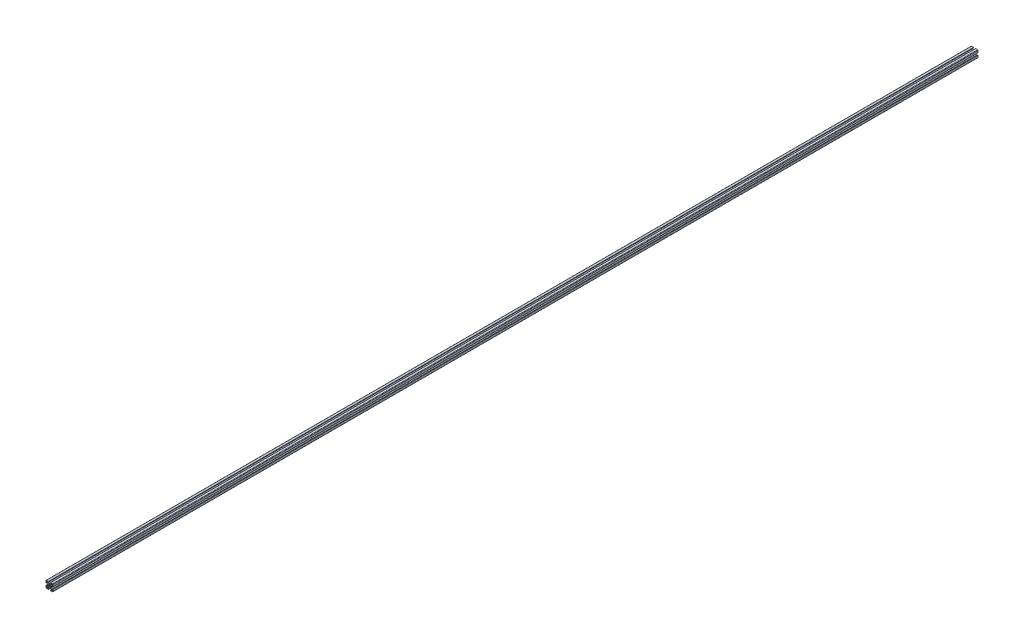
from build123d import *

# Parameters (mm, degrees)
EXTRUDE1_DEPTH = 4000


with BuildPart() as part:
    # Sketch1 → Extrude1 (new body)
    with BuildSketch(Plane.XY):
        with BuildLine():
            Line((12.74247465, -4.5), (12.74247465, -7.732519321))
            ThreePointArc((12.74247465, -7.732519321), (12.602449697, -8.097296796), (12.242781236, -8.249967))
            Line((12.242781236, -8.249967), (10.260188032, -8.249967))
            ThreePointArc((10.260188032, -8.249967), (10.068847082, -8.211906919), (9.906636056, -8.103520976))
            Line((9.906636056, -8.103520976), (5.981117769, -4.178002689))
            ThreePointArc((5.981117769, -4.178002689), (5.872731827, -4.015791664), (5.834671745, -3.824450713))
            Line((5.834671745, -3.824450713), (5.834671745, -1.01249595))
            Line((5.834671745, -1.01249595), (5.324673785, -0.06249975))
            Line((5.324673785, -0.06249975), (5.834671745, 0.88749645))
            Line((5.834671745, 0.88749645), (5.834671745, 3.824450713))
            ThreePointArc((5.834671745, 3.824450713), (5.872731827, 4.015791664), (5.981117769, 4.178002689))
            Line((5.981117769, 4.178002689), (9.906636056, 8.103520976))
            ThreePointArc((9.906636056, 8.103520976), (10.068847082, 8.211906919), (10.260188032, 8.249967))
            Line((10.260188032, 8.249967), (12.242781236, 8.249967))
            ThreePointArc((12.242781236, 8.249967), (12.602449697, 8.097296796), (12.74247465, 7.732519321))
            Line((12.74247465, 7.732519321), (12.74247465, 4.5))
            ThreePointArc((12.74247465, 4.5), (12.88892126, 4.146446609), (13.24247465, 4))
            Line((13.24247465, 4), (14.49994, 4))
            ThreePointArc((14.49994, 4), (14.853493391, 4.146446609), (14.99994, 4.5))
            Line((14.99994, 4.5), (14.99994, 12.999948))
            ThreePointArc((14.99994, 12.999948), (14.414155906, 14.414155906), (12.999948, 14.99994))
            Line((12.999948, 14.99994), (4.5, 14.99994))
            ThreePointArc((4.5, 14.99994), (4.146446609, 14.853493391), (4, 14.49994))
            Line((4, 14.49994), (4, 13.24247465))
            ThreePointArc((4, 13.24247465), (4.146446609, 12.88892126), (4.5, 12.74247465))
            Line((4.5, 12.74247465), (7.732519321, 12.74247465))
            ThreePointArc((7.732519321, 12.74247465), (8.097296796, 12.602449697), (8.249967, 12.242781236))
            Line((8.249967, 12.242781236), (8.249967, 10.260188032))
            ThreePointArc((8.249967, 10.260188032), (8.211906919, 10.068847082), (8.103520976, 9.906636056))
            Line((8.103520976, 9.906636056), (4.178002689, 5.981117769))
            ThreePointArc((4.178002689, 5.981117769), (4.015791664, 5.872731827), (3.824450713, 5.834671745))
            Line((3.824450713, 5.834671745), (0.9499962, 5.834671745))
            Line((0.9499962, 5.834671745), (0, 5.324673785))
            Line((0, 5.324673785), (-0.9499962, 5.834671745))
            Line((-0.9499962, 5.834671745), (-3.824450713, 5.834671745))
            ThreePointArc((-3.824450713, 5.834671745), (-4.015791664, 5.872731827), (-4.178002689, 5.981117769))
            Line((-4.178002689, 5.981117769), (-8.103520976, 9.906636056))
            ThreePointArc((-8.103520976, 9.906636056), (-8.211906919, 10.068847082), (-8.249967, 10.260188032))
            Line((-8.249967, 10.260188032), (-8.249967, 12.242781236))
            ThreePointArc((-8.249967, 12.242781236), (-8.097296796, 12.602449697), (-7.732519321, 12.74247465))
            Line((-7.732519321, 12.74247465), (-4.5, 12.74247465))
            ThreePointArc((-4.5, 12.74247465), (-4.146446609, 12.88892126), (-4, 13.24247465))
            Line((-4, 13.24247465), (-4, 14.49994))
            ThreePointArc((-4, 14.49994), (-4.146446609, 14.853493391), (-4.5, 14.99994))
            Line((-4.5, 14.99994), (-12.999948, 14.99994))
            ThreePointArc((-12.999948, 14.99994), (-14.414155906, 14.414155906), (-14.99994, 12.999948))
            Line((-14.99994, 12.999948), (-14.99994, 4.5))
            ThreePointArc((-14.99994, 4.5), (-14.853493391, 4.146446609), (-14.49994, 4))
            Line((-14.49994, 4), (-13.24247465, 4))
            ThreePointArc((-13.24247465, 4), (-12.88892126, 4.146446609), (-12.74247465, 4.5))
            Line((-12.74247465, 4.5), (-12.74247465, 7.732519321))
            ThreePointArc((-12.74247465, 7.732519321), (-12.602449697, 8.097296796), (-12.242781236, 8.249967))
            Line((-12.242781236, 8.249967), (-10.260188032, 8.249967))
            ThreePointArc((-10.260188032, 8.249967), (-10.068847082, 8.211906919), (-9.906636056, 8.103520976))
            Line((-9.906636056, 8.103520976), (-5.981117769, 4.178002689))
            ThreePointArc((-5.981117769, 4.178002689), (-5.872731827, 4.015791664), (-5.834671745, 3.824450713))
            Line((-5.834671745, 3.824450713), (-5.834671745, 0.88749645))
            Line((-5.834671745, 0.88749645), (-5.324673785, -0.06249975))
            Line((-5.324673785, -0.06249975), (-5.834671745, -1.01249595))
            Line((-5.834671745, -1.01249595), (-5.834671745, -3.824450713))
            ThreePointArc((-5.834671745, -3.824450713), (-5.872731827, -4.015791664), (-5.981117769, -4.178002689))
            Line((-5.981117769, -4.178002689), (-9.906636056, -8.103520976))
            ThreePointArc((-9.906636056, -8.103520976), (-10.068847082, -8.211906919), (-10.260188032, -8.249967))
            Line((-10.260188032, -8.249967), (-12.242781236, -8.249967))
            ThreePointArc((-12.242781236, -8.249967), (-12.602449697, -8.097296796), (-12.74247465, -7.732519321))
            Line((-12.74247465, -7.732519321), (-12.74247465, -4.5))
            ThreePointArc((-12.74247465, -4.5), (-12.88892126, -4.146446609), (-13.24247465, -4))
            Line((-13.24247465, -4), (-14.49994, -4))
            ThreePointArc((-14.49994, -4), (-14.853493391, -4.146446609), (-14.99994, -4.5))
            Line((-14.99994, -4.5), (-14.99994, -12.999948))
            ThreePointArc((-14.99994, -12.999948), (-14.414155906, -14.414155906), (-12.999948, -14.99994))
            Line((-12.999948, -14.99994), (-4.5, -14.99994))
            ThreePointArc((-4.5, -14.99994), (-4.146446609, -14.853493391), (-4, -14.49994))
            Line((-4, -14.49994), (-4, -13.24247465))
            ThreePointArc((-4, -13.24247465), (-4.146446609, -12.88892126), (-4.5, -12.74247465))
            Line((-4.5, -12.74247465), (-7.732519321, -12.74247465))
            ThreePointArc((-7.732519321, -12.74247465), (-8.097296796, -12.602449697), (-8.249967, -12.242781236))
            Line((-8.249967, -12.242781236), (-8.249967, -10.260188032))
            ThreePointArc((-8.249967, -10.260188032), (-8.211906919, -10.068847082), (-8.103520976, -9.906636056))
            Line((-8.103520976, -9.906636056), (-4.178002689, -5.981117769))
            ThreePointArc((-4.178002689, -5.981117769), (-4.015791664, -5.872731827), (-3.824450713, -5.834671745))
            Line((-3.824450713, -5.834671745), (-0.9499962, -5.834671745))
            Line((-0.9499962, -5.834671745), (0, -5.324673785))
            Line((0, -5.324673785), (0.9499962, -5.834671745))
            Line((0.9499962, -5.834671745), (3.824450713, -5.834671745))
            ThreePointArc((3.824450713, -5.834671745), (4.015791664, -5.872731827), (4.178002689, -5.981117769))
            Line((4.178002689, -5.981117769), (8.103520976, -9.906636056))
            ThreePointArc((8.103520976, -9.906636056), (8.211906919, -10.068847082), (8.249967, -10.260188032))
            Line((8.249967, -10.260188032), (8.249967, -12.242781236))
            ThreePointArc((8.249967, -12.242781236), (8.097296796, -12.602449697), (7.732519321, -12.74247465))
            Line((7.732519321, -12.74247465), (4.5, -12.74247465))
            ThreePointArc((4.5, -12.74247465), (4.146446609, -12.88892126), (4, -13.24247465))
            Line((4, -13.24247465), (4, -14.49994))
            ThreePointArc((4, -14.49994), (4.146446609, -14.853493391), (4.5, -14.99994))
            Line((4.5, -14.99994), (12.999948, -14.99994))
            ThreePointArc((12.999948, -14.99994), (14.414155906, -14.414155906), (14.99994, -12.999948))
            Line((14.99994, -12.999948), (14.99994, -4.5))
            ThreePointArc((14.99994, -4.5), (14.853493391, -4.146446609), (14.49994, -4))
            Line((14.49994, -4), (13.24247465, -4))
            ThreePointArc((13.24247465, -4), (12.88892126, -4.146446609), (12.74247465, -4.5))
        make_face()
        with BuildLine():
            Line((9.499962, -13.318946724), (9.499962, -9.87996048))
            ThreePointArc((9.499962, -9.87996048), (9.611260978, -9.611260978), (9.87996048, -9.499962))
            Line((9.87996048, -9.499962), (13.318946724, -9.499962))
            ThreePointArc((13.318946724, -9.499962), (13.58835333, -9.61155387), (13.6999452, -9.880960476))
            Line((13.6999452, -9.880960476), (13.6999452, -12.6999492))
            ThreePointArc((13.6999452, -12.6999492), (13.407053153, -13.407053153), (12.6999492, -13.6999452))
            Line((12.6999492, -13.6999452), (9.880960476, -13.6999452))
            ThreePointArc((9.880960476, -13.6999452), (9.61155387, -13.58835333), (9.499962, -13.318946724))
        make_face(mode=Mode.SUBTRACT)
        with BuildLine():
            Line((-13.318946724, -9.499962), (-9.87996048, -9.499962))
            ThreePointArc((-9.87996048, -9.499962), (-9.611260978, -9.611260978), (-9.499962, -9.87996048))
            Line((-9.499962, -9.87996048), (-9.499962, -13.318946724))
            ThreePointArc((-9.499962, -13.318946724), (-9.61155387, -13.58835333), (-9.880960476, -13.6999452))
            Line((-9.880960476, -13.6999452), (-12.6999492, -13.6999452))
            ThreePointArc((-12.6999492, -13.6999452), (-13.407053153, -13.407053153), (-13.6999452, -12.6999492))
            Line((-13.6999452, -12.6999492), (-13.6999452, -9.880960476))
            ThreePointArc((-13.6999452, -9.880960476), (-13.58835333, -9.61155387), (-13.318946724, -9.499962))
        make_face(mode=Mode.SUBTRACT)
        with BuildLine():
            Line((-1.494225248, -3.198138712), (-2.473341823, -3.979927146))
            ThreePointArc((-2.473341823, -3.979927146), (-3.900227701, -3.900227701), (-3.979927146, -2.473341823))
            Line((-3.979927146, -2.473341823), (-3.198138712, -1.494225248))
            ThreePointArc((-3.198138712, -1.494225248), (-3.52998588, 0), (-3.198138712, 1.494225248))
            Line((-3.198138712, 1.494225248), (-3.979927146, 2.473341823))
            ThreePointArc((-3.979927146, 2.473341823), (-3.900227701, 3.900227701), (-2.473341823, 3.979927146))
            Line((-2.473341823, 3.979927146), (-1.494225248, 3.198138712))
            ThreePointArc((-1.494225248, 3.198138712), (0, 3.52998588), (1.494225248, 3.198138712))
            Line((1.494225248, 3.198138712), (2.473341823, 3.979927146))
            ThreePointArc((2.473341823, 3.979927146), (3.900227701, 3.900227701), (3.979927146, 2.473341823))
            Line((3.979927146, 2.473341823), (3.198138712, 1.494225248))
            ThreePointArc((3.198138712, 1.494225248), (3.52998588, 0), (3.198138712, -1.494225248))
            Line((3.198138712, -1.494225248), (3.979927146, -2.473341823))
            ThreePointArc((3.979927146, -2.473341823), (3.900227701, -3.900227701), (2.473341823, -3.979927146))
            Line((2.473341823, -3.979927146), (1.494225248, -3.198138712))
            ThreePointArc((1.494225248, -3.198138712), (0, -3.52998588), (-1.494225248, -3.198138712))
        make_face(mode=Mode.SUBTRACT)
        with BuildLine():
            Line((-9.499962, 13.318946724), (-9.499962, 9.87996048))
            ThreePointArc((-9.499962, 9.87996048), (-9.611260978, 9.611260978), (-9.87996048, 9.499962))
            Line((-9.87996048, 9.499962), (-13.318946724, 9.499962))
            ThreePointArc((-13.318946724, 9.499962), (-13.58835333, 9.61155387), (-13.6999452, 9.880960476))
            Line((-13.6999452, 9.880960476), (-13.6999452, 12.6999492))
            ThreePointArc((-13.6999452, 12.6999492), (-13.407053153, 13.407053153), (-12.6999492, 13.6999452))
            Line((-12.6999492, 13.6999452), (-9.880960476, 13.6999452))
            ThreePointArc((-9.880960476, 13.6999452), (-9.61155387, 13.58835333), (-9.499962, 13.318946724))
        make_face(mode=Mode.SUBTRACT)
        with BuildLine():
            Line((9.880960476, 13.6999452), (12.6999492, 13.6999452))
            ThreePointArc((12.6999492, 13.6999452), (13.407053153, 13.407053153), (13.6999452, 12.6999492))
            Line((13.6999452, 12.6999492), (13.6999452, 9.880960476))
            ThreePointArc((13.6999452, 9.880960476), (13.58835333, 9.61155387), (13.318946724, 9.499962))
            Line((13.318946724, 9.499962), (9.87996048, 9.499962))
            ThreePointArc((9.87996048, 9.499962), (9.611260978, 9.611260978), (9.499962, 9.87996048))
            Line((9.499962, 9.87996048), (9.499962, 13.318946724))
            ThreePointArc((9.499962, 13.318946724), (9.61155387, 13.58835333), (9.880960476, 13.6999452))
        make_face(mode=Mode.SUBTRACT)
    extrude(amount=-EXTRUDE1_DEPTH)


solid = part.part
